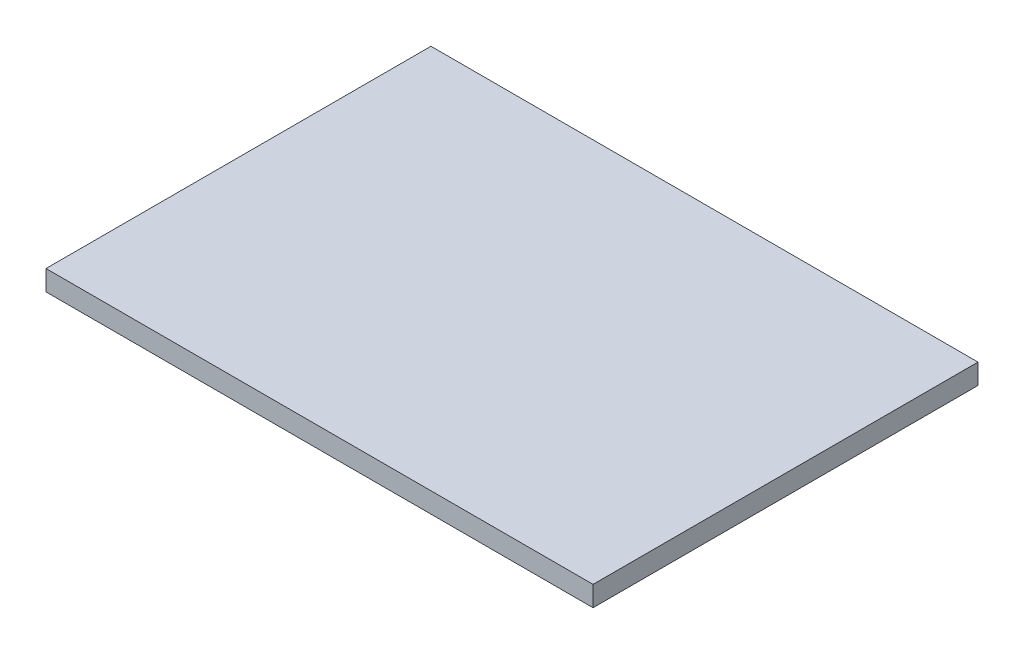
ISO-10303-21;
HEADER;
FILE_DESCRIPTION(('STEP AP214'),'2;1');
FILE_NAME('part.step','',(''),(''),'','','');
FILE_SCHEMA(('AUTOMOTIVE_DESIGN { 1 0 10303 214 1 1 1 1 }'));
ENDSEC;
DATA;
#1=APPLICATION_CONTEXT('core data for automotive mechanical design processes');
#2=APPLICATION_PROTOCOL_DEFINITION('international standard','automotive_design',2000,#1);
#3=PRODUCT_CONTEXT('',#1,'mechanical');
#4=PRODUCT('Part','Part','',(#3));
#5=PRODUCT_RELATED_PRODUCT_CATEGORY('part','',(#4));
#6=PRODUCT_DEFINITION_FORMATION('','',#4);
#7=PRODUCT_DEFINITION_CONTEXT('part definition',#1,'design');
#8=PRODUCT_DEFINITION('design','',#6,#7);
#9=PRODUCT_DEFINITION_SHAPE('','',#8);
#10=(LENGTH_UNIT() NAMED_UNIT(*) SI_UNIT(.MILLI.,.METRE.));
#11=(NAMED_UNIT(*) PLANE_ANGLE_UNIT() SI_UNIT($,.RADIAN.));
#12=(NAMED_UNIT(*) SI_UNIT($,.STERADIAN.) SOLID_ANGLE_UNIT());
#13=UNCERTAINTY_MEASURE_WITH_UNIT(LENGTH_MEASURE(1.E-05),#10,'distance_accuracy_value','');
#14=(GEOMETRIC_REPRESENTATION_CONTEXT(3) GLOBAL_UNCERTAINTY_ASSIGNED_CONTEXT((#13)) GLOBAL_UNIT_ASSIGNED_CONTEXT((#10,
#11,#12)) REPRESENTATION_CONTEXT('',''));
#15=CARTESIAN_POINT('',(0.,0.,0.));
#16=DIRECTION('',(0.,0.,1.));
#17=DIRECTION('',(1.,0.,0.));
#18=AXIS2_PLACEMENT_3D('',#15,#16,#17);
#19=CARTESIAN_POINT('',(0.,6.35,0.));
#20=DIRECTION('',(1.,0.,0.));
#21=DIRECTION('',(0.,0.,-1.));
#22=AXIS2_PLACEMENT_3D('',#19,#20,#21);
#23=PLANE('',#22);
#24=DIRECTION('',(0.,0.,1.));
#25=VECTOR('',#24,1.);
#26=CARTESIAN_POINT('',(0.,0.,0.));
#27=LINE('',#26,#25);
#28=CARTESIAN_POINT('',(0.,0.,-120.65));
#29=VERTEX_POINT('',#28);
#30=CARTESIAN_POINT('',(0.,0.,0.));
#31=VERTEX_POINT('',#30);
#32=EDGE_CURVE('E113',#29,#31,#27,.T.);
#33=ORIENTED_EDGE('',*,*,#32,.T.);
#34=DIRECTION('',(0.,-1.,0.));
#35=VECTOR('',#34,1.);
#36=CARTESIAN_POINT('',(0.,6.35,0.));
#37=LINE('',#36,#35);
#38=CARTESIAN_POINT('',(0.,6.35,0.));
#39=VERTEX_POINT('',#38);
#40=EDGE_CURVE('E11',#39,#31,#37,.T.);
#41=ORIENTED_EDGE('',*,*,#40,.F.);
#42=DIRECTION('',(0.,0.,1.));
#43=VECTOR('',#42,1.);
#44=CARTESIAN_POINT('',(0.,6.35,0.));
#45=LINE('',#44,#43);
#46=CARTESIAN_POINT('',(0.,6.35,-120.65));
#47=VERTEX_POINT('',#46);
#48=EDGE_CURVE('E97',#47,#39,#45,.T.);
#49=ORIENTED_EDGE('',*,*,#48,.F.);
#50=DIRECTION('',(0.,-1.,0.));
#51=VECTOR('',#50,1.);
#52=CARTESIAN_POINT('',(0.,6.35,-120.65));
#53=LINE('',#52,#51);
#54=EDGE_CURVE('E109',#47,#29,#53,.T.);
#55=ORIENTED_EDGE('',*,*,#54,.T.);
#56=EDGE_LOOP('',(#33,#41,#49,#55));
#57=FACE_BOUND('',#56,.T.);
#58=ADVANCED_FACE('F45',(#57),#23,.F.);
#59=CARTESIAN_POINT('',(0.,6.35,0.));
#60=DIRECTION('',(0.,0.,-1.));
#61=DIRECTION('',(-1.,0.,0.));
#62=AXIS2_PLACEMENT_3D('',#59,#60,#61);
#63=PLANE('',#62);
#64=DIRECTION('',(1.,0.,0.));
#65=VECTOR('',#64,1.);
#66=CARTESIAN_POINT('',(0.,0.,0.));
#67=LINE('',#66,#65);
#68=CARTESIAN_POINT('',(171.45,0.,0.));
#69=VERTEX_POINT('',#68);
#70=EDGE_CURVE('E102',#31,#69,#67,.T.);
#71=ORIENTED_EDGE('',*,*,#70,.T.);
#72=DIRECTION('',(0.,-1.,0.));
#73=VECTOR('',#72,1.);
#74=CARTESIAN_POINT('',(171.45,6.35,0.));
#75=LINE('',#74,#73);
#76=CARTESIAN_POINT('',(171.45,6.35,0.));
#77=VERTEX_POINT('',#76);
#78=EDGE_CURVE('E54',#77,#69,#75,.T.);
#79=ORIENTED_EDGE('',*,*,#78,.F.);
#80=DIRECTION('',(1.,0.,0.));
#81=VECTOR('',#80,1.);
#82=CARTESIAN_POINT('',(0.,6.35,0.));
#83=LINE('',#82,#81);
#84=EDGE_CURVE('E92',#39,#77,#83,.T.);
#85=ORIENTED_EDGE('',*,*,#84,.F.);
#86=ORIENTED_EDGE('',*,*,#40,.T.);
#87=EDGE_LOOP('',(#71,#79,#85,#86));
#88=FACE_BOUND('',#87,.T.);
#89=ADVANCED_FACE('F101',(#88),#63,.F.);
#90=CARTESIAN_POINT('',(171.45,6.35,0.));
#91=DIRECTION('',(-1.,0.,0.));
#92=DIRECTION('',(0.,0.,1.));
#93=AXIS2_PLACEMENT_3D('',#90,#91,#92);
#94=PLANE('',#93);
#95=DIRECTION('',(0.,0.,-1.));
#96=VECTOR('',#95,1.);
#97=CARTESIAN_POINT('',(171.45,0.,0.));
#98=LINE('',#97,#96);
#99=CARTESIAN_POINT('',(171.45,0.,-120.65));
#100=VERTEX_POINT('',#99);
#101=EDGE_CURVE('E79',#69,#100,#98,.T.);
#102=ORIENTED_EDGE('',*,*,#101,.T.);
#103=DIRECTION('',(0.,-1.,0.));
#104=VECTOR('',#103,1.);
#105=CARTESIAN_POINT('',(171.45,6.35,-120.65));
#106=LINE('',#105,#104);
#107=CARTESIAN_POINT('',(171.45,6.35,-120.65));
#108=VERTEX_POINT('',#107);
#109=EDGE_CURVE('E104',#108,#100,#106,.T.);
#110=ORIENTED_EDGE('',*,*,#109,.F.);
#111=DIRECTION('',(0.,0.,-1.));
#112=VECTOR('',#111,1.);
#113=CARTESIAN_POINT('',(171.45,6.35,0.));
#114=LINE('',#113,#112);
#115=EDGE_CURVE('E95',#77,#108,#114,.T.);
#116=ORIENTED_EDGE('',*,*,#115,.F.);
#117=ORIENTED_EDGE('',*,*,#78,.T.);
#118=EDGE_LOOP('',(#102,#110,#116,#117));
#119=FACE_BOUND('',#118,.T.);
#120=ADVANCED_FACE('F105',(#119),#94,.F.);
#121=CARTESIAN_POINT('',(0.,6.35,-120.65));
#122=DIRECTION('',(0.,0.,1.));
#123=DIRECTION('',(1.,0.,0.));
#124=AXIS2_PLACEMENT_3D('',#121,#122,#123);
#125=PLANE('',#124);
#126=DIRECTION('',(-1.,0.,0.));
#127=VECTOR('',#126,1.);
#128=CARTESIAN_POINT('',(0.,0.,-120.65));
#129=LINE('',#128,#127);
#130=EDGE_CURVE('E85',#100,#29,#129,.T.);
#131=ORIENTED_EDGE('',*,*,#130,.T.);
#132=ORIENTED_EDGE('',*,*,#54,.F.);
#133=DIRECTION('',(-1.,0.,0.));
#134=VECTOR('',#133,1.);
#135=CARTESIAN_POINT('',(0.,6.35,-120.65));
#136=LINE('',#135,#134);
#137=EDGE_CURVE('E62',#108,#47,#136,.T.);
#138=ORIENTED_EDGE('',*,*,#137,.F.);
#139=ORIENTED_EDGE('',*,*,#109,.T.);
#140=EDGE_LOOP('',(#131,#132,#138,#139));
#141=FACE_BOUND('',#140,.T.);
#142=ADVANCED_FACE('F126',(#141),#125,.F.);
#143=CARTESIAN_POINT('',(0.,6.35,0.));
#144=DIRECTION('',(0.,-1.,0.));
#145=DIRECTION('',(0.,0.,-1.));
#146=AXIS2_PLACEMENT_3D('',#143,#144,#145);
#147=PLANE('',#146);
#148=ORIENTED_EDGE('',*,*,#48,.T.);
#149=ORIENTED_EDGE('',*,*,#84,.T.);
#150=ORIENTED_EDGE('',*,*,#115,.T.);
#151=ORIENTED_EDGE('',*,*,#137,.T.);
#152=EDGE_LOOP('',(#148,#149,#150,#151));
#153=FACE_BOUND('',#152,.T.);
#154=ADVANCED_FACE('F93',(#153),#147,.F.);
#155=CARTESIAN_POINT('',(0.,0.,0.));
#156=DIRECTION('',(0.,-1.,0.));
#157=DIRECTION('',(0.,0.,-1.));
#158=AXIS2_PLACEMENT_3D('',#155,#156,#157);
#159=PLANE('',#158);
#160=ORIENTED_EDGE('',*,*,#32,.F.);
#161=ORIENTED_EDGE('',*,*,#130,.F.);
#162=ORIENTED_EDGE('',*,*,#101,.F.);
#163=ORIENTED_EDGE('',*,*,#70,.F.);
#164=EDGE_LOOP('',(#160,#161,#162,#163));
#165=FACE_BOUND('',#164,.T.);
#166=ADVANCED_FACE('F129',(#165),#159,.T.);
#167=CLOSED_SHELL('',(#58,#89,#120,#142,#154,#166));
#168=MANIFOLD_SOLID_BREP('B2',#167);
#169=ADVANCED_BREP_SHAPE_REPRESENTATION('',(#18,#168),#14);
#170=SHAPE_DEFINITION_REPRESENTATION(#9,#169);
ENDSEC;
END-ISO-10303-21;
